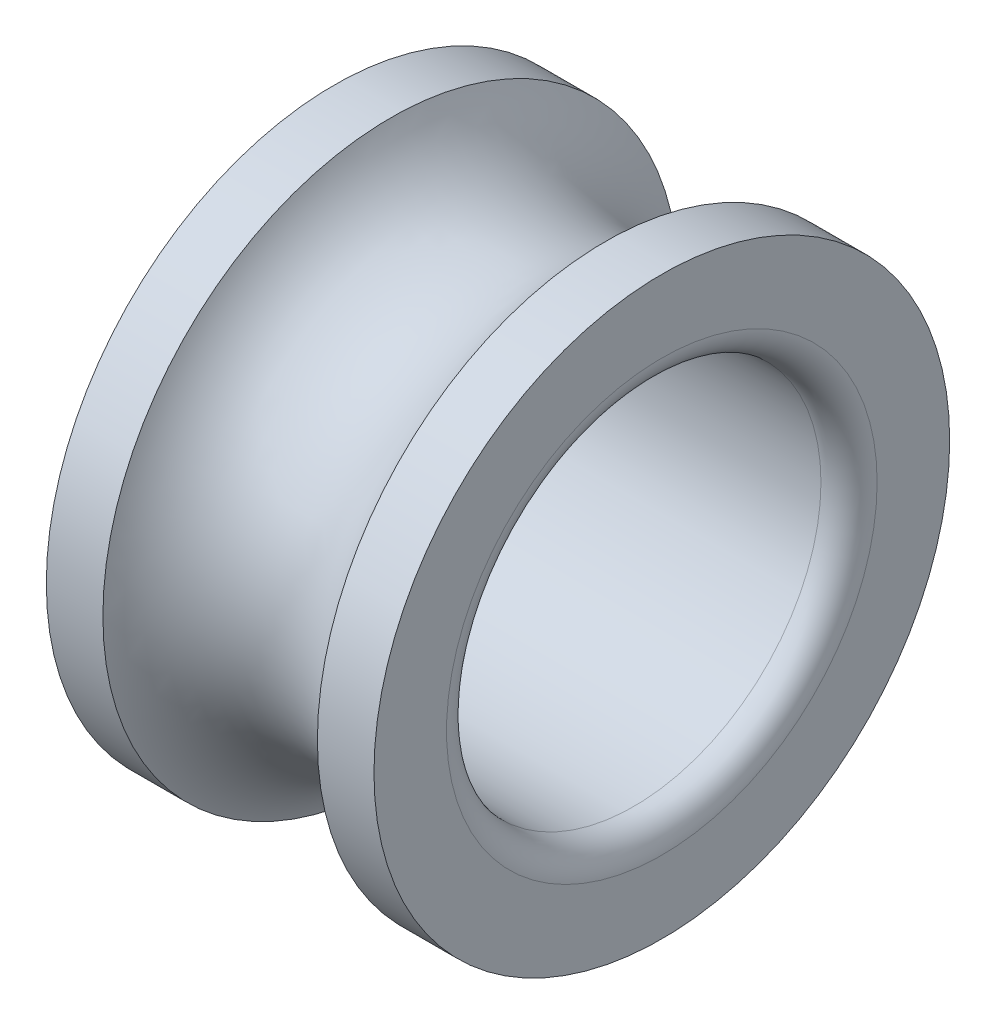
from build123d import *


with BuildPart() as part:
    # Sketch1 → Revolve1 (revolve)
    with BuildSketch(Plane.XY, mode=Mode.PRIVATE) as revolve1_sk:
        with BuildLine():
            Line((0.6, 4), (6.4, 4))
            ThreePointArc((6.4, 4), (6.824264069, 4.175735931), (7, 4.6))
            Line((7, 4.6), (7, 6.15))
            Line((7, 6.15), (5.791287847, 6.15))
            ThreePointArc((5.791287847, 6.15), (3.5, 4.65), (1.208712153, 6.15))
            Line((1.208712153, 6.15), (0, 6.15))
            Line((0, 6.15), (0, 4.6))
            ThreePointArc((0, 4.6), (0.175735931, 4.175735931), (0.6, 4))
        make_face()
    revolve(revolve1_sk.sketch.rotate(Axis((9, 0, 0), (-1, 0, 0)), 90), axis=Axis((9, 0, 0), (-1, 0, 0)))


solid = part.part
